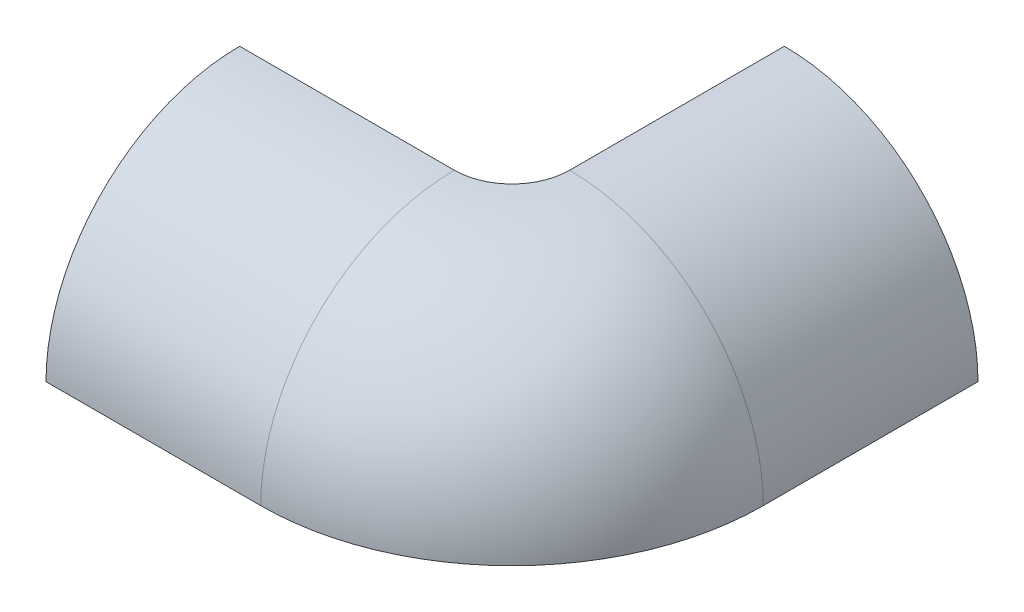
ISO-10303-21;
HEADER;
FILE_DESCRIPTION(('STEP AP214'),'2;1');
FILE_NAME('part.step','',(''),(''),'','','');
FILE_SCHEMA(('AUTOMOTIVE_DESIGN { 1 0 10303 214 1 1 1 1 }'));
ENDSEC;
DATA;
#1=APPLICATION_CONTEXT('core data for automotive mechanical design processes');
#2=APPLICATION_PROTOCOL_DEFINITION('international standard','automotive_design',2000,#1);
#3=PRODUCT_CONTEXT('',#1,'mechanical');
#4=PRODUCT('Part','Part','',(#3));
#5=PRODUCT_RELATED_PRODUCT_CATEGORY('part','',(#4));
#6=PRODUCT_DEFINITION_FORMATION('','',#4);
#7=PRODUCT_DEFINITION_CONTEXT('part definition',#1,'design');
#8=PRODUCT_DEFINITION('design','',#6,#7);
#9=PRODUCT_DEFINITION_SHAPE('','',#8);
#10=(LENGTH_UNIT() NAMED_UNIT(*) SI_UNIT(.MILLI.,.METRE.));
#11=(NAMED_UNIT(*) PLANE_ANGLE_UNIT() SI_UNIT($,.RADIAN.));
#12=(NAMED_UNIT(*) SI_UNIT($,.STERADIAN.) SOLID_ANGLE_UNIT());
#13=UNCERTAINTY_MEASURE_WITH_UNIT(LENGTH_MEASURE(1.E-05),#10,'distance_accuracy_value','');
#14=(GEOMETRIC_REPRESENTATION_CONTEXT(3) GLOBAL_UNCERTAINTY_ASSIGNED_CONTEXT((#13)) GLOBAL_UNIT_ASSIGNED_CONTEXT((#10,
#11,#12)) REPRESENTATION_CONTEXT('',''));
#15=CARTESIAN_POINT('',(0.,0.,0.));
#16=DIRECTION('',(0.,0.,1.));
#17=DIRECTION('',(1.,0.,0.));
#18=AXIS2_PLACEMENT_3D('',#15,#16,#17);
#19=CARTESIAN_POINT('',(71.4390320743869,0.,-15.1103610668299));
#20=DIRECTION('',(-1.,0.,0.));
#21=DIRECTION('',(0.,0.,1.));
#22=AXIS2_PLACEMENT_3D('',#19,#20,#21);
#23=PLANE('',#22);
#24=DIRECTION('',(0.,1.,0.));
#25=VECTOR('',#24,1.);
#26=CARTESIAN_POINT('',(71.4390320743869,0.,-15.1103610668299));
#27=LINE('',#26,#25);
#28=CARTESIAN_POINT('',(71.4390320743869,0.,-15.1103610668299));
#29=VERTEX_POINT('',#28);
#30=CARTESIAN_POINT('',(71.4390320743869,50.8,-15.1103610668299));
#31=VERTEX_POINT('',#30);
#32=EDGE_CURVE('E108',#29,#31,#27,.T.);
#33=ORIENTED_EDGE('',*,*,#32,.T.);
#34=DIRECTION('',(0.,0.,-1.));
#35=VECTOR('',#34,1.);
#36=CARTESIAN_POINT('',(71.4390320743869,50.8,-15.1103610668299));
#37=LINE('',#36,#35);
#38=CARTESIAN_POINT('',(71.4390320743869,50.8,-71.4390320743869));
#39=VERTEX_POINT('',#38);
#40=EDGE_CURVE('E132',#31,#39,#37,.T.);
#41=ORIENTED_EDGE('',*,*,#40,.T.);
#42=DIRECTION('',(0.,1.,0.));
#43=VECTOR('',#42,1.);
#44=CARTESIAN_POINT('',(71.4390320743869,0.,-71.4390320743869));
#45=LINE('',#44,#43);
#46=CARTESIAN_POINT('',(71.4390320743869,0.,-71.4390320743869));
#47=VERTEX_POINT('',#46);
#48=EDGE_CURVE('E118',#47,#39,#45,.T.);
#49=ORIENTED_EDGE('',*,*,#48,.F.);
#50=DIRECTION('',(0.,0.,-1.));
#51=VECTOR('',#50,1.);
#52=CARTESIAN_POINT('',(71.4390320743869,0.,-15.1103610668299));
#53=LINE('',#52,#51);
#54=EDGE_CURVE('E127',#29,#47,#53,.T.);
#55=ORIENTED_EDGE('',*,*,#54,.F.);
#56=EDGE_LOOP('',(#33,#41,#49,#55));
#57=FACE_BOUND('',#56,.T.);
#58=ADVANCED_FACE('F31',(#57),#23,.T.);
#59=CARTESIAN_POINT('',(56.328671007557,0.,-15.1103610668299));
#60=DIRECTION('',(0.,1.,0.));
#61=DIRECTION('',(0.,0.,1.));
#62=AXIS2_PLACEMENT_3D('',#59,#60,#61);
#63=CYLINDRICAL_SURFACE('',#62,15.1103610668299);
#64=DIRECTION('',(0.,1.,0.));
#65=VECTOR('',#64,1.);
#66=CARTESIAN_POINT('',(56.328671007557,0.,0.));
#67=LINE('',#66,#65);
#68=CARTESIAN_POINT('',(56.328671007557,0.,0.));
#69=VERTEX_POINT('',#68);
#70=CARTESIAN_POINT('',(56.328671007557,50.8,0.));
#71=VERTEX_POINT('',#70);
#72=EDGE_CURVE('E84',#69,#71,#67,.T.);
#73=ORIENTED_EDGE('',*,*,#72,.T.);
#74=CARTESIAN_POINT('',(56.328671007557,50.8,-15.1103610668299));
#75=DIRECTION('',(0.,1.,0.));
#76=DIRECTION('',(0.,0.,1.));
#77=AXIS2_PLACEMENT_3D('',#74,#75,#76);
#78=CIRCLE('',#77,15.1103610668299);
#79=EDGE_CURVE('E89',#71,#31,#78,.T.);
#80=ORIENTED_EDGE('',*,*,#79,.T.);
#81=ORIENTED_EDGE('',*,*,#32,.F.);
#82=CARTESIAN_POINT('',(56.328671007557,0.,-15.1103610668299));
#83=DIRECTION('',(0.,1.,0.));
#84=DIRECTION('',(0.,0.,1.));
#85=AXIS2_PLACEMENT_3D('',#82,#83,#84);
#86=CIRCLE('',#85,15.1103610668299);
#87=EDGE_CURVE('E92',#69,#29,#86,.T.);
#88=ORIENTED_EDGE('',*,*,#87,.F.);
#89=EDGE_LOOP('',(#73,#80,#81,#88));
#90=FACE_BOUND('',#89,.T.);
#91=ADVANCED_FACE('F86',(#90),#63,.F.);
#92=CARTESIAN_POINT('',(56.328671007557,0.,0.));
#93=DIRECTION('',(0.,0.,1.));
#94=DIRECTION('',(1.,0.,0.));
#95=AXIS2_PLACEMENT_3D('',#92,#93,#94);
#96=PLANE('',#95);
#97=DIRECTION('',(0.,1.,0.));
#98=VECTOR('',#97,1.);
#99=CARTESIAN_POINT('',(0.,0.,0.));
#100=LINE('',#99,#98);
#101=CARTESIAN_POINT('',(0.,0.,0.));
#102=VERTEX_POINT('',#101);
#103=CARTESIAN_POINT('',(0.,50.8,0.));
#104=VERTEX_POINT('',#103);
#105=EDGE_CURVE('E105',#102,#104,#100,.T.);
#106=ORIENTED_EDGE('',*,*,#105,.T.);
#107=DIRECTION('',(-1.,0.,0.));
#108=VECTOR('',#107,1.);
#109=CARTESIAN_POINT('',(56.328671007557,50.8,0.));
#110=LINE('',#109,#108);
#111=EDGE_CURVE('E101',#71,#104,#110,.T.);
#112=ORIENTED_EDGE('',*,*,#111,.F.);
#113=ORIENTED_EDGE('',*,*,#72,.F.);
#114=DIRECTION('',(-1.,0.,0.));
#115=VECTOR('',#114,1.);
#116=CARTESIAN_POINT('',(56.328671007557,0.,0.));
#117=LINE('',#116,#115);
#118=EDGE_CURVE('E96',#69,#102,#117,.T.);
#119=ORIENTED_EDGE('',*,*,#118,.T.);
#120=EDGE_LOOP('',(#106,#112,#113,#119));
#121=FACE_BOUND('',#120,.T.);
#122=ADVANCED_FACE('F103',(#121),#96,.F.);
#123=CARTESIAN_POINT('',(56.328671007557,0.,0.));
#124=DIRECTION('',(0.,1.,0.));
#125=DIRECTION('',(0.,0.,1.));
#126=AXIS2_PLACEMENT_3D('',#123,#124,#125);
#127=PLANE('',#126);
#128=DIRECTION('',(0.,0.,-1.));
#129=VECTOR('',#128,1.);
#130=CARTESIAN_POINT('',(0.,0.,0.));
#131=LINE('',#130,#129);
#132=CARTESIAN_POINT('',(0.,0.,50.8));
#133=VERTEX_POINT('',#132);
#134=EDGE_CURVE('E97',#133,#102,#131,.T.);
#135=ORIENTED_EDGE('',*,*,#134,.T.);
#136=ORIENTED_EDGE('',*,*,#118,.F.);
#137=ORIENTED_EDGE('',*,*,#87,.T.);
#138=ORIENTED_EDGE('',*,*,#54,.T.);
#139=DIRECTION('',(-1.,0.,0.));
#140=VECTOR('',#139,1.);
#141=CARTESIAN_POINT('',(71.4390320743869,0.,-71.4390320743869));
#142=LINE('',#141,#140);
#143=CARTESIAN_POINT('',(122.239032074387,0.,-71.4390320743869));
#144=VERTEX_POINT('',#143);
#145=EDGE_CURVE('E121',#144,#47,#142,.T.);
#146=ORIENTED_EDGE('',*,*,#145,.F.);
#147=DIRECTION('',(0.,0.,-1.));
#148=VECTOR('',#147,1.);
#149=CARTESIAN_POINT('',(122.239032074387,0.,-15.1103610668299));
#150=LINE('',#149,#148);
#151=CARTESIAN_POINT('',(122.239032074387,0.,-15.1103610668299));
#152=VERTEX_POINT('',#151);
#153=EDGE_CURVE('E130',#152,#144,#150,.T.);
#154=ORIENTED_EDGE('',*,*,#153,.F.);
#155=CARTESIAN_POINT('',(56.328671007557,0.,-15.1103610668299));
#156=DIRECTION('',(0.,1.,0.));
#157=DIRECTION('',(0.,0.,1.));
#158=AXIS2_PLACEMENT_3D('',#155,#156,#157);
#159=CIRCLE('',#158,65.9103610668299);
#160=CARTESIAN_POINT('',(56.328671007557,0.,50.8));
#161=VERTEX_POINT('',#160);
#162=EDGE_CURVE('E119',#161,#152,#159,.T.);
#163=ORIENTED_EDGE('',*,*,#162,.F.);
#164=DIRECTION('',(-1.,0.,0.));
#165=VECTOR('',#164,1.);
#166=CARTESIAN_POINT('',(56.328671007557,0.,50.8));
#167=LINE('',#166,#165);
#168=EDGE_CURVE('E109',#161,#133,#167,.T.);
#169=ORIENTED_EDGE('',*,*,#168,.T.);
#170=EDGE_LOOP('',(#135,#136,#137,#138,#146,#154,#163,#169));
#171=FACE_BOUND('',#170,.T.);
#172=ADVANCED_FACE('F144',(#171),#127,.F.);
#173=CARTESIAN_POINT('',(71.4390320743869,50.8,-71.4390320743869));
#174=DIRECTION('',(0.,0.,-1.));
#175=DIRECTION('',(-1.,0.,0.));
#176=AXIS2_PLACEMENT_3D('',#173,#174,#175);
#177=PLANE('',#176);
#178=ORIENTED_EDGE('',*,*,#48,.T.);
#179=CARTESIAN_POINT('',(71.4390320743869,0.,-71.4390320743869));
#180=DIRECTION('',(0.,0.,-1.));
#181=DIRECTION('',(-1.,0.,0.));
#182=AXIS2_PLACEMENT_3D('',#179,#180,#181);
#183=CIRCLE('',#182,50.8);
#184=EDGE_CURVE('E40',#39,#144,#183,.T.);
#185=ORIENTED_EDGE('',*,*,#184,.T.);
#186=ORIENTED_EDGE('',*,*,#145,.T.);
#187=EDGE_LOOP('',(#178,#185,#186));
#188=FACE_BOUND('',#187,.T.);
#189=ADVANCED_FACE('F148',(#188),#177,.T.);
#190=CARTESIAN_POINT('',(0.,50.8,0.));
#191=DIRECTION('',(1.,0.,0.));
#192=DIRECTION('',(0.,0.,-1.));
#193=AXIS2_PLACEMENT_3D('',#190,#191,#192);
#194=PLANE('',#193);
#195=ORIENTED_EDGE('',*,*,#134,.F.);
#196=CARTESIAN_POINT('',(0.,0.,0.));
#197=DIRECTION('',(1.,0.,0.));
#198=DIRECTION('',(0.,0.,-1.));
#199=AXIS2_PLACEMENT_3D('',#196,#197,#198);
#200=CIRCLE('',#199,50.8);
#201=EDGE_CURVE('E11',#133,#104,#200,.F.);
#202=ORIENTED_EDGE('',*,*,#201,.T.);
#203=ORIENTED_EDGE('',*,*,#105,.F.);
#204=EDGE_LOOP('',(#195,#202,#203));
#205=FACE_BOUND('',#204,.T.);
#206=ADVANCED_FACE('F146',(#205),#194,.F.);
#207=CARTESIAN_POINT('',(56.328671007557,0.,0.));
#208=DIRECTION('',(-1.,0.,0.));
#209=DIRECTION('',(0.,0.,1.));
#210=AXIS2_PLACEMENT_3D('',#207,#208,#209);
#211=CYLINDRICAL_SURFACE('',#210,50.8);
#212=ORIENTED_EDGE('',*,*,#201,.F.);
#213=ORIENTED_EDGE('',*,*,#168,.F.);
#214=CARTESIAN_POINT('',(56.328671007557,0.,0.));
#215=DIRECTION('',(1.,0.,0.));
#216=DIRECTION('',(0.,0.,-1.));
#217=AXIS2_PLACEMENT_3D('',#214,#215,#216);
#218=CIRCLE('',#217,50.8);
#219=EDGE_CURVE('E35',#71,#161,#218,.T.);
#220=ORIENTED_EDGE('',*,*,#219,.F.);
#221=ORIENTED_EDGE('',*,*,#111,.T.);
#222=EDGE_LOOP('',(#212,#213,#220,#221));
#223=FACE_BOUND('',#222,.T.);
#224=ADVANCED_FACE('F33',(#223),#211,.T.);
#225=CARTESIAN_POINT('',(56.328671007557,0.,-15.1103610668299));
#226=DIRECTION('',(0.,-1.,0.));
#227=DIRECTION('',(0.,0.,-1.));
#228=AXIS2_PLACEMENT_3D('',#225,#226,#227);
#229=DEGENERATE_TOROIDAL_SURFACE('',#228,15.1103610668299,50.8,.T.);
#230=ORIENTED_EDGE('',*,*,#219,.T.);
#231=ORIENTED_EDGE('',*,*,#162,.T.);
#232=CARTESIAN_POINT('',(71.4390320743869,0.,-15.1103610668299));
#233=DIRECTION('',(0.,0.,-1.));
#234=DIRECTION('',(-1.,0.,0.));
#235=AXIS2_PLACEMENT_3D('',#232,#233,#234);
#236=CIRCLE('',#235,50.8);
#237=EDGE_CURVE('E115',#31,#152,#236,.T.);
#238=ORIENTED_EDGE('',*,*,#237,.F.);
#239=ORIENTED_EDGE('',*,*,#79,.F.);
#240=EDGE_LOOP('',(#230,#231,#238,#239));
#241=FACE_BOUND('',#240,.T.);
#242=ADVANCED_FACE('F116',(#241),#229,.T.);
#243=CARTESIAN_POINT('',(71.4390320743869,0.,0.));
#244=DIRECTION('',(0.,0.,1.));
#245=DIRECTION('',(1.,0.,0.));
#246=AXIS2_PLACEMENT_3D('',#243,#244,#245);
#247=CYLINDRICAL_SURFACE('',#246,50.8);
#248=ORIENTED_EDGE('',*,*,#237,.T.);
#249=ORIENTED_EDGE('',*,*,#153,.T.);
#250=ORIENTED_EDGE('',*,*,#184,.F.);
#251=ORIENTED_EDGE('',*,*,#40,.F.);
#252=EDGE_LOOP('',(#248,#249,#250,#251));
#253=FACE_BOUND('',#252,.T.);
#254=ADVANCED_FACE('F135',(#253),#247,.T.);
#255=CLOSED_SHELL('',(#58,#91,#122,#172,#189,#206,#224,#242,#254));
#256=MANIFOLD_SOLID_BREP('B2',#255);
#257=ADVANCED_BREP_SHAPE_REPRESENTATION('',(#18,#256),#14);
#258=SHAPE_DEFINITION_REPRESENTATION(#9,#257);
ENDSEC;
END-ISO-10303-21;
